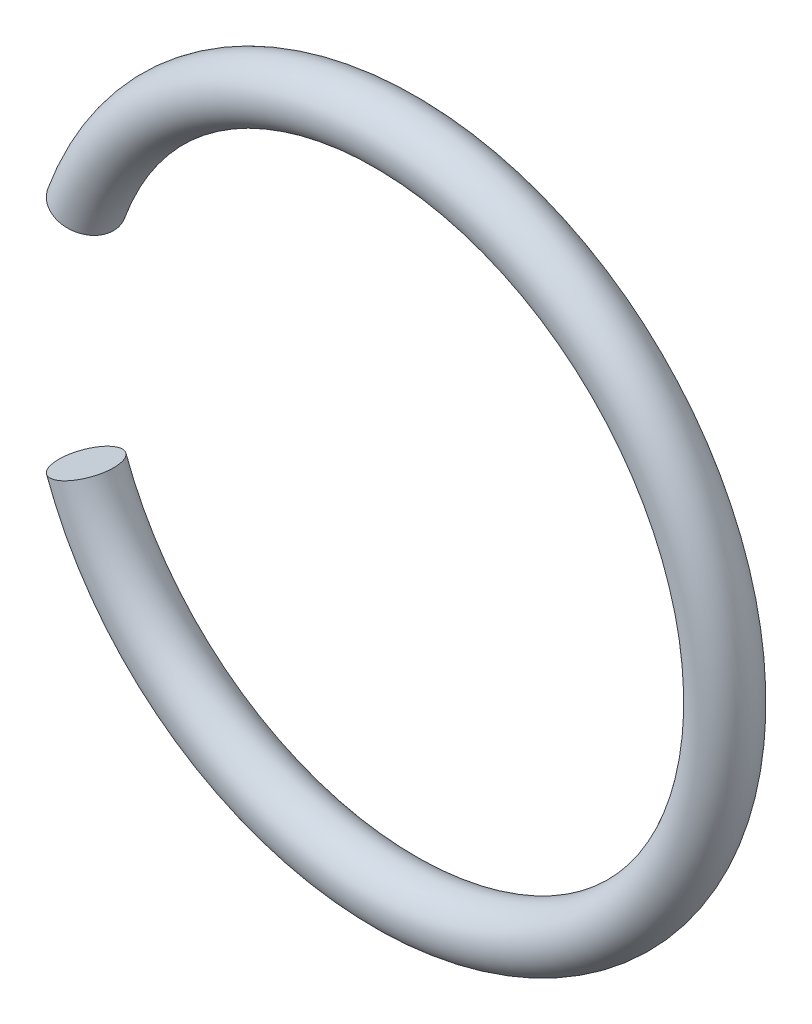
ISO-10303-21;
HEADER;
FILE_DESCRIPTION(('STEP AP214'),'2;1');
FILE_NAME('part.step','',(''),(''),'','','');
FILE_SCHEMA(('AUTOMOTIVE_DESIGN { 1 0 10303 214 1 1 1 1 }'));
ENDSEC;
DATA;
#1=APPLICATION_CONTEXT('core data for automotive mechanical design processes');
#2=APPLICATION_PROTOCOL_DEFINITION('international standard','automotive_design',2000,#1);
#3=PRODUCT_CONTEXT('',#1,'mechanical');
#4=PRODUCT('Part','Part','',(#3));
#5=PRODUCT_RELATED_PRODUCT_CATEGORY('part','',(#4));
#6=PRODUCT_DEFINITION_FORMATION('','',#4);
#7=PRODUCT_DEFINITION_CONTEXT('part definition',#1,'design');
#8=PRODUCT_DEFINITION('design','',#6,#7);
#9=PRODUCT_DEFINITION_SHAPE('','',#8);
#10=(LENGTH_UNIT() NAMED_UNIT(*) SI_UNIT(.MILLI.,.METRE.));
#11=(NAMED_UNIT(*) PLANE_ANGLE_UNIT() SI_UNIT($,.RADIAN.));
#12=(NAMED_UNIT(*) SI_UNIT($,.STERADIAN.) SOLID_ANGLE_UNIT());
#13=UNCERTAINTY_MEASURE_WITH_UNIT(LENGTH_MEASURE(1.E-05),#10,'distance_accuracy_value','');
#14=(GEOMETRIC_REPRESENTATION_CONTEXT(3) GLOBAL_UNCERTAINTY_ASSIGNED_CONTEXT((#13)) GLOBAL_UNIT_ASSIGNED_CONTEXT((#10,
#11,#12)) REPRESENTATION_CONTEXT('',''));
#15=CARTESIAN_POINT('',(0.,0.,0.));
#16=DIRECTION('',(0.,0.,1.));
#17=DIRECTION('',(1.,0.,0.));
#18=AXIS2_PLACEMENT_3D('',#15,#16,#17);
#19=CARTESIAN_POINT('',(0.,0.,0.));
#20=DIRECTION('',(0.,0.,-1.));
#21=DIRECTION('',(-1.,0.,0.));
#22=AXIS2_PLACEMENT_3D('',#19,#20,#21);
#23=TOROIDAL_SURFACE('',#22,8.9154,0.787400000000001);
#24=CARTESIAN_POINT('',(-8.37773559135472,3.04924638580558,0.));
#25=DIRECTION('',(-0.342020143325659,-0.939692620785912,0.));
#26=DIRECTION('',(0.,0.,1.));
#27=AXIS2_PLACEMENT_3D('',#24,#25,#26);
#28=CIRCLE('',#27,0.787400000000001);
#29=CARTESIAN_POINT('',(-9.11764956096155,3.3185530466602,0.));
#30=VERTEX_POINT('',#29);
#31=EDGE_CURVE('E10',#30,#30,#28,.T.);
#32=CARTESIAN_POINT('',(-8.37773559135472,-3.04924638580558,0.));
#33=DIRECTION('',(0.342020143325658,-0.939692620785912,0.));
#34=DIRECTION('',(0.,0.,1.));
#35=AXIS2_PLACEMENT_3D('',#32,#33,#34);
#36=CIRCLE('',#35,0.787400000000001);
#37=CARTESIAN_POINT('',(-9.11764956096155,-3.3185530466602,0.));
#38=VERTEX_POINT('',#37);
#39=EDGE_CURVE('E35',#38,#38,#36,.T.);
#40=CARTESIAN_POINT('',(0.,0.,0.));
#41=DIRECTION('',(0.,0.,-1.));
#42=DIRECTION('',(-1.,0.,0.));
#43=AXIS2_PLACEMENT_3D('',#40,#41,#42);
#44=CIRCLE('',#43,9.7028);
#45=EDGE_CURVE('',#30,#38,#44,.T.);
#46=ORIENTED_EDGE('',*,*,#31,.F.);
#47=ORIENTED_EDGE('',*,*,#39,.T.);
#48=ORIENTED_EDGE('',*,*,#45,.T.);
#49=ORIENTED_EDGE('',*,*,#45,.F.);
#50=EDGE_LOOP('',(#46,#48,#47,#49));
#51=FACE_BOUND('',#50,.T.);
#52=ADVANCED_FACE('F29',(#51),#23,.T.);
#53=CARTESIAN_POINT('',(-8.37773559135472,3.04924638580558,0.));
#54=DIRECTION('',(-0.342020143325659,-0.939692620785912,0.));
#55=DIRECTION('',(0.,0.,1.));
#56=AXIS2_PLACEMENT_3D('',#53,#54,#55);
#57=PLANE('',#56);
#58=ORIENTED_EDGE('',*,*,#31,.T.);
#59=EDGE_LOOP('',(#58));
#60=FACE_BOUND('',#59,.T.);
#61=ADVANCED_FACE('F44',(#60),#57,.T.);
#62=CARTESIAN_POINT('',(-8.37773559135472,-3.04924638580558,0.));
#63=DIRECTION('',(0.342020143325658,-0.939692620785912,0.));
#64=DIRECTION('',(0.,0.,1.));
#65=AXIS2_PLACEMENT_3D('',#62,#63,#64);
#66=PLANE('',#65);
#67=ORIENTED_EDGE('',*,*,#39,.F.);
#68=EDGE_LOOP('',(#67));
#69=FACE_BOUND('',#68,.T.);
#70=ADVANCED_FACE('F42',(#69),#66,.F.);
#71=CLOSED_SHELL('',(#52,#61,#70));
#72=MANIFOLD_SOLID_BREP('B2',#71);
#73=ADVANCED_BREP_SHAPE_REPRESENTATION('',(#18,#72),#14);
#74=SHAPE_DEFINITION_REPRESENTATION(#9,#73);
ENDSEC;
END-ISO-10303-21;
